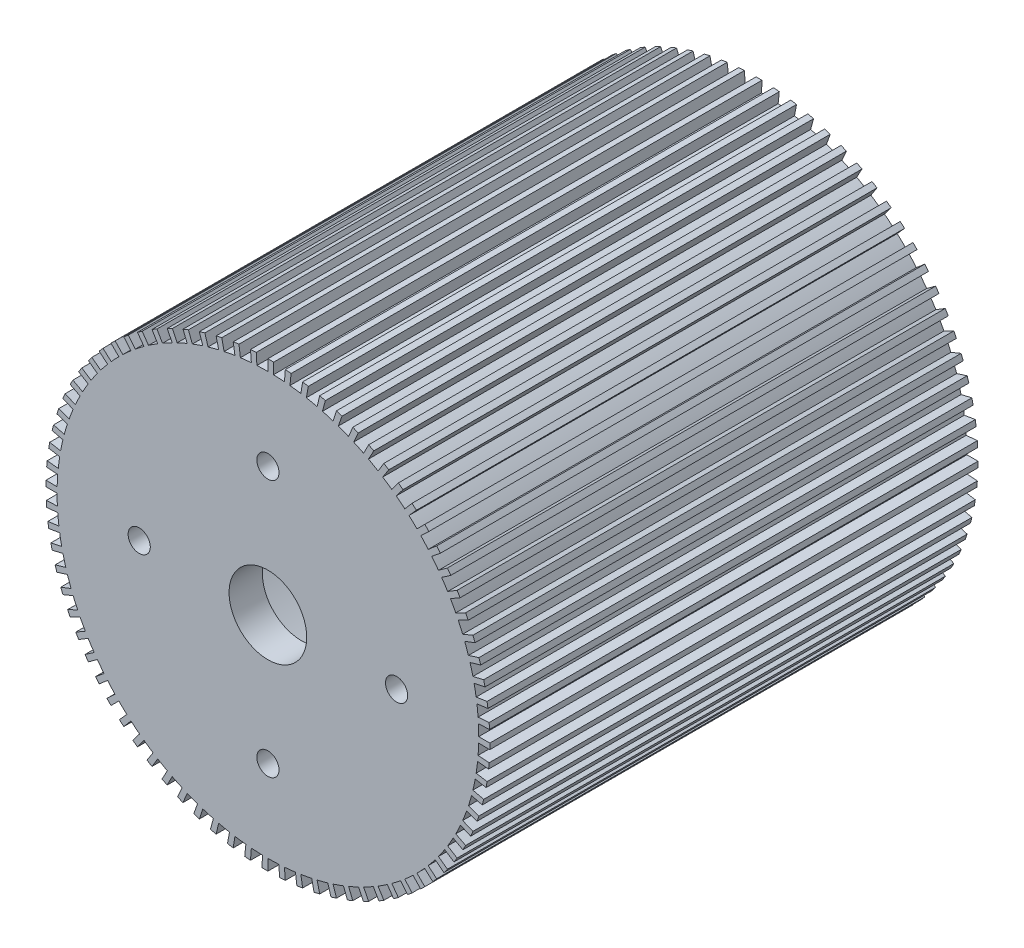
from build123d import *

# Parameters (mm, degrees)
CROQUIS1_R              = 100
SALIENTE_EXTRUIR1_DEPTH = 220
CORTAR_EXTRUIR2_DEPTH   = 220
CROQUIS5_R              = 90
CORTAR_EXTRUIR3_DEPTH   = 205
CORTAR_EXTRUIR4_REACH   = 263.534
CROQUIS6_R              = 17.5
CORTAR_EXTRUIR5_REACH   = 263.534
CROQUIS7_R              = 5


with BuildPart() as part:
    # Croquis1 → Saliente-Extruir1 (new body)
    with BuildSketch(Plane.XY):
        Circle(CROQUIS1_R)
    extrude(amount=SALIENTE_EXTRUIR1_DEPTH)

    # Croquis4 → Cortar-Extruir2 (cut)
    with BuildSketch(Plane(origin=(0, 0, 0), x_dir=(-1, 0, 0), z_dir=(0, 0, -1))):
        with BuildLine():
            Line((0, 95), (0, 100))
            ThreePointArc((0, 100), (2.617694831, 99.965732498), (5.233595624, 99.862953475))
            Line((5.233595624, 99.862953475), (4.971915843, 94.869805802))
            ThreePointArc((4.971915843, 94.869805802), (2.486810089, 94.967445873), (0, 95))
        make_face()
        with BuildLine():
            Line((7.453614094, 94.707146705), (7.845909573, 99.691733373))
            ThreePointArc((7.845909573, 99.691733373), (10.452846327, 99.452189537), (13.052619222, 99.144486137))
            Line((13.052619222, 99.144486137), (12.399988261, 94.187261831))
            ThreePointArc((12.399988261, 94.187261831), (9.93020401, 94.47958006), (7.453614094, 94.707146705))
        make_face()
        with BuildLine():
            Line((14.861274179, 93.830392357), (15.643446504, 98.76883406))
            ThreePointArc((15.643446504, 98.76883406), (18.223552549, 98.325490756), (20.791169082, 97.814760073))
            Line((20.791169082, 97.814760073), (19.751610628, 92.92402207))
            ThreePointArc((19.751610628, 92.92402207), (17.312374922, 93.409216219), (14.861274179, 93.830392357))
        make_face()
        with BuildLine():
            Line((22.177309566, 92.375142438), (23.344536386, 97.23699204))
            ThreePointArc((23.344536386, 97.23699204), (25.88190451, 96.592582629), (28.40153447, 95.881973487))
            Line((28.40153447, 95.881973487), (26.981457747, 91.087874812))
            ThreePointArc((26.981457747, 91.087874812), (24.587809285, 91.762953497), (22.177309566, 92.375142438))
        make_face()
        with BuildLine():
            Line((29.356614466, 90.350369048), (30.901699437, 95.10565163))
            ThreePointArc((30.901699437, 95.10565163), (33.380685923, 94.264149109), (35.836794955, 93.35804265))
            Line((35.836794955, 93.35804265), (34.044955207, 88.690140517))
            ThreePointArc((34.044955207, 88.690140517), (31.711651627, 89.550941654), (29.356614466, 90.350369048))
        make_face()
        with BuildLine():
            Line((36.354926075, 87.768555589), (38.268343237, 92.387953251))
            ThreePointArc((38.268343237, 92.387953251), (40.673664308, 91.354545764), (43.051109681, 90.258528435))
            Line((43.051109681, 90.258528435), (40.898554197, 85.745602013))
            ThreePointArc((40.898554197, 85.745602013), (38.639981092, 86.786818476), (36.354926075, 87.768555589))
        make_face()
        with BuildLine():
            Line((43.129097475, 84.645619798), (45.399049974, 89.100652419))
            ThreePointArc((45.399049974, 89.100652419), (47.715876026, 87.881711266), (50, 86.602540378))
            Line((50, 86.602540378), (47.5, 82.27241336))
            ThreePointArc((47.5, 82.27241336), (45.330082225, 83.487625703), (43.129097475, 84.645619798))
        make_face()
        with BuildLine():
            Line((49.637363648, 81.000815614), (52.249856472, 85.264016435))
            ThreePointArc((52.249856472, 85.264016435), (54.463903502, 83.867056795), (56.640623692, 82.412618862))
            Line((56.640623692, 82.412618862), (53.808592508, 78.291987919))
            ThreePointArc((53.808592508, 78.291987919), (51.740708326, 79.673703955), (49.637363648, 81.000815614))
        make_face()
        with BuildLine():
            Line((55.839598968, 76.856614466), (58.778525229, 80.901699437))
            ThreePointArc((58.778525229, 80.901699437), (60.876142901, 79.335334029), (62.932039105, 77.714596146))
            Line((62.932039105, 77.714596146), (59.78543715, 73.828866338))
            ThreePointArc((59.78543715, 73.828866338), (57.832335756, 75.368567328), (55.839598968, 76.856614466))
        make_face()
        with BuildLine():
            Line((61.697564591, 72.238566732), (64.944804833, 76.04059656))
            ThreePointArc((64.944804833, 76.04059656), (66.913060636, 74.314482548), (68.835457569, 72.537437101))
            Line((68.835457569, 72.537437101), (65.393684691, 68.910565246))
            ThreePointArc((65.393684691, 68.910565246), (63.567407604, 70.59875842), (61.697564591, 72.238566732))
        make_face()
        with BuildLine():
            Line((67.175144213, 67.175144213), (70.710678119, 70.710678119))
            ThreePointArc((70.710678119, 70.710678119), (72.537437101, 68.835457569), (74.314482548, 66.913060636))
            Line((74.314482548, 66.913060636), (70.59875842, 63.567407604))
            ThreePointArc((70.59875842, 63.567407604), (68.910565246, 65.393684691), (67.175144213, 67.175144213))
        make_face()
        with BuildLine():
            Line((72.238566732, 61.697564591), (76.04059656, 64.944804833))
            ThreePointArc((76.04059656, 64.944804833), (77.714596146, 62.932039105), (79.335334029, 60.876142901))
            Line((79.335334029, 60.876142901), (75.368567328, 57.832335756))
            ThreePointArc((75.368567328, 57.832335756), (73.828866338, 59.78543715), (72.238566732, 61.697564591))
        make_face()
        with BuildLine():
            Line((76.856614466, 55.839598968), (80.901699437, 58.778525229))
            ThreePointArc((80.901699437, 58.778525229), (82.412618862, 56.640623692), (83.867056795, 54.463903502))
            Line((83.867056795, 54.463903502), (79.673703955, 51.740708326))
            ThreePointArc((79.673703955, 51.740708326), (78.291987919, 53.808592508), (76.856614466, 55.839598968))
        make_face()
        with BuildLine():
            Line((81.000815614, 49.637363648), (85.264016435, 52.249856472))
            ThreePointArc((85.264016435, 52.249856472), (86.602540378, 50), (87.881711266, 47.715876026))
            Line((87.881711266, 47.715876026), (83.487625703, 45.330082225))
            ThreePointArc((83.487625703, 45.330082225), (82.27241336, 47.5), (81.000815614, 49.637363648))
        make_face()
        with BuildLine():
            Line((84.645619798, 43.129097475), (89.100652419, 45.399049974))
            ThreePointArc((89.100652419, 45.399049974), (90.258528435, 43.051109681), (91.354545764, 40.673664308))
            Line((91.354545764, 40.673664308), (86.786818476, 38.639981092))
            ThreePointArc((86.786818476, 38.639981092), (85.745602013, 40.898554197), (84.645619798, 43.129097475))
        make_face()
        with BuildLine():
            Line((87.768555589, 36.354926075), (92.387953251, 38.268343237))
            ThreePointArc((92.387953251, 38.268343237), (93.35804265, 35.836794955), (94.264149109, 33.380685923))
            Line((94.264149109, 33.380685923), (89.550941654, 31.711651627))
            ThreePointArc((89.550941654, 31.711651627), (88.690140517, 34.044955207), (87.768555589, 36.354926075))
        make_face()
        with BuildLine():
            Line((90.350369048, 29.356614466), (95.10565163, 30.901699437))
            ThreePointArc((95.10565163, 30.901699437), (95.881973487, 28.40153447), (96.592582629, 25.88190451))
            Line((96.592582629, 25.88190451), (91.762953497, 24.587809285))
            ThreePointArc((91.762953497, 24.587809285), (91.087874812, 26.981457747), (90.350369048, 29.356614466))
        make_face()
        with BuildLine():
            Line((92.375142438, 22.177309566), (97.23699204, 23.344536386))
            ThreePointArc((97.23699204, 23.344536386), (97.814760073, 20.791169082), (98.325490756, 18.223552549))
            Line((98.325490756, 18.223552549), (93.409216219, 17.312374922))
            ThreePointArc((93.409216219, 17.312374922), (92.92402207, 19.751610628), (92.375142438, 22.177309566))
        make_face()
        with BuildLine():
            Line((93.830392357, 14.861274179), (98.76883406, 15.643446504))
            ThreePointArc((98.76883406, 15.643446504), (99.144486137, 13.052619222), (99.452189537, 10.452846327))
            Line((99.452189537, 10.452846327), (94.47958006, 9.93020401))
            ThreePointArc((94.47958006, 9.93020401), (94.187261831, 12.399988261), (93.830392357, 14.861274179))
        make_face()
        with BuildLine():
            Line((94.707146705, 7.453614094), (99.691733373, 7.845909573))
            ThreePointArc((99.691733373, 7.845909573), (99.862953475, 5.233595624), (99.965732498, 2.617694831))
            Line((99.965732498, 2.617694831), (94.967445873, 2.486810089))
            ThreePointArc((94.967445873, 2.486810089), (94.869805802, 4.971915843), (94.707146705, 7.453614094))
        make_face()
        with BuildLine():
            Line((95, 0), (100, 0))
            ThreePointArc((100, 0), (99.965732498, -2.617694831), (99.862953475, -5.233595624))
            Line((99.862953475, -5.233595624), (94.869805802, -4.971915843))
            ThreePointArc((94.869805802, -4.971915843), (94.967445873, -2.486810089), (95, 0))
        make_face()
        with BuildLine():
            Line((94.707146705, -7.453614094), (99.691733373, -7.845909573))
            ThreePointArc((99.691733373, -7.845909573), (99.452189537, -10.452846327), (99.144486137, -13.052619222))
            Line((99.144486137, -13.052619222), (94.187261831, -12.399988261))
            ThreePointArc((94.187261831, -12.399988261), (94.47958006, -9.93020401), (94.707146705, -7.453614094))
        make_face()
        with BuildLine():
            Line((93.830392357, -14.861274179), (98.76883406, -15.643446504))
            ThreePointArc((98.76883406, -15.643446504), (98.325490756, -18.223552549), (97.814760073, -20.791169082))
            Line((97.814760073, -20.791169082), (92.92402207, -19.751610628))
            ThreePointArc((92.92402207, -19.751610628), (93.409216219, -17.312374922), (93.830392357, -14.861274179))
        make_face()
        with BuildLine():
            Line((92.375142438, -22.177309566), (97.23699204, -23.344536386))
            ThreePointArc((97.23699204, -23.344536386), (96.592582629, -25.88190451), (95.881973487, -28.40153447))
            Line((95.881973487, -28.40153447), (91.087874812, -26.981457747))
            ThreePointArc((91.087874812, -26.981457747), (91.762953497, -24.587809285), (92.375142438, -22.177309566))
        make_face()
        with BuildLine():
            Line((90.350369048, -29.356614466), (95.10565163, -30.901699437))
            ThreePointArc((95.10565163, -30.901699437), (94.264149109, -33.380685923), (93.35804265, -35.836794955))
            Line((93.35804265, -35.836794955), (88.690140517, -34.044955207))
            ThreePointArc((88.690140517, -34.044955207), (89.550941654, -31.711651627), (90.350369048, -29.356614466))
        make_face()
        with BuildLine():
            Line((87.768555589, -36.354926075), (92.387953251, -38.268343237))
            ThreePointArc((92.387953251, -38.268343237), (91.354545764, -40.673664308), (90.258528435, -43.051109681))
            Line((90.258528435, -43.051109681), (85.745602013, -40.898554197))
            ThreePointArc((85.745602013, -40.898554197), (86.786818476, -38.639981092), (87.768555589, -36.354926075))
        make_face()
        with BuildLine():
            Line((84.645619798, -43.129097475), (89.100652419, -45.399049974))
            ThreePointArc((89.100652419, -45.399049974), (87.881711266, -47.715876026), (86.602540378, -50))
            Line((86.602540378, -50), (82.27241336, -47.5))
            ThreePointArc((82.27241336, -47.5), (83.487625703, -45.330082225), (84.645619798, -43.129097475))
        make_face()
        with BuildLine():
            Line((81.000815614, -49.637363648), (85.264016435, -52.249856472))
            ThreePointArc((85.264016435, -52.249856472), (83.867056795, -54.463903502), (82.412618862, -56.640623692))
            Line((82.412618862, -56.640623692), (78.291987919, -53.808592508))
            ThreePointArc((78.291987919, -53.808592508), (79.673703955, -51.740708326), (81.000815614, -49.637363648))
        make_face()
        with BuildLine():
            Line((76.856614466, -55.839598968), (80.901699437, -58.778525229))
            ThreePointArc((80.901699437, -58.778525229), (79.335334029, -60.876142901), (77.714596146, -62.932039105))
            Line((77.714596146, -62.932039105), (73.828866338, -59.78543715))
            ThreePointArc((73.828866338, -59.78543715), (75.368567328, -57.832335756), (76.856614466, -55.839598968))
        make_face()
        with BuildLine():
            Line((72.238566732, -61.697564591), (76.04059656, -64.944804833))
            ThreePointArc((76.04059656, -64.944804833), (74.314482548, -66.913060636), (72.537437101, -68.835457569))
            Line((72.537437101, -68.835457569), (68.910565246, -65.393684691))
            ThreePointArc((68.910565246, -65.393684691), (70.59875842, -63.567407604), (72.238566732, -61.697564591))
        make_face()
        with BuildLine():
            Line((67.175144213, -67.175144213), (70.710678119, -70.710678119))
            ThreePointArc((70.710678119, -70.710678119), (68.835457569, -72.537437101), (66.913060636, -74.314482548))
            Line((66.913060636, -74.314482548), (63.567407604, -70.59875842))
            ThreePointArc((63.567407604, -70.59875842), (65.393684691, -68.910565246), (67.175144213, -67.175144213))
        make_face()
        with BuildLine():
            Line((61.697564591, -72.238566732), (64.944804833, -76.04059656))
            ThreePointArc((64.944804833, -76.04059656), (62.932039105, -77.714596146), (60.876142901, -79.335334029))
            Line((60.876142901, -79.335334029), (57.832335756, -75.368567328))
            ThreePointArc((57.832335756, -75.368567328), (59.78543715, -73.828866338), (61.697564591, -72.238566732))
        make_face()
        with BuildLine():
            Line((55.839598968, -76.856614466), (58.778525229, -80.901699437))
            ThreePointArc((58.778525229, -80.901699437), (56.640623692, -82.412618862), (54.463903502, -83.867056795))
            Line((54.463903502, -83.867056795), (51.740708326, -79.673703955))
            ThreePointArc((51.740708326, -79.673703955), (53.808592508, -78.291987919), (55.839598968, -76.856614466))
        make_face()
        with BuildLine():
            Line((49.637363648, -81.000815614), (52.249856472, -85.264016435))
            ThreePointArc((52.249856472, -85.264016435), (50, -86.602540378), (47.715876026, -87.881711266))
            Line((47.715876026, -87.881711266), (45.330082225, -83.487625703))
            ThreePointArc((45.330082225, -83.487625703), (47.5, -82.27241336), (49.637363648, -81.000815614))
        make_face()
        with BuildLine():
            Line((43.129097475, -84.645619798), (45.399049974, -89.100652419))
            ThreePointArc((45.399049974, -89.100652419), (43.051109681, -90.258528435), (40.673664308, -91.354545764))
            Line((40.673664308, -91.354545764), (38.639981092, -86.786818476))
            ThreePointArc((38.639981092, -86.786818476), (40.898554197, -85.745602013), (43.129097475, -84.645619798))
        make_face()
        with BuildLine():
            Line((36.354926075, -87.768555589), (38.268343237, -92.387953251))
            ThreePointArc((38.268343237, -92.387953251), (35.836794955, -93.35804265), (33.380685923, -94.264149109))
            Line((33.380685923, -94.264149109), (31.711651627, -89.550941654))
            ThreePointArc((31.711651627, -89.550941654), (34.044955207, -88.690140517), (36.354926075, -87.768555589))
        make_face()
        with BuildLine():
            Line((29.356614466, -90.350369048), (30.901699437, -95.10565163))
            ThreePointArc((30.901699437, -95.10565163), (28.40153447, -95.881973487), (25.88190451, -96.592582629))
            Line((25.88190451, -96.592582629), (24.587809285, -91.762953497))
            ThreePointArc((24.587809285, -91.762953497), (26.981457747, -91.087874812), (29.356614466, -90.350369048))
        make_face()
        with BuildLine():
            Line((22.177309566, -92.375142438), (23.344536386, -97.23699204))
            ThreePointArc((23.344536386, -97.23699204), (20.791169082, -97.814760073), (18.223552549, -98.325490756))
            Line((18.223552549, -98.325490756), (17.312374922, -93.409216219))
            ThreePointArc((17.312374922, -93.409216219), (19.751610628, -92.92402207), (22.177309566, -92.375142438))
        make_face()
        with BuildLine():
            Line((14.861274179, -93.830392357), (15.643446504, -98.76883406))
            ThreePointArc((15.643446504, -98.76883406), (13.052619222, -99.144486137), (10.452846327, -99.452189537))
            Line((10.452846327, -99.452189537), (9.93020401, -94.47958006))
            ThreePointArc((9.93020401, -94.47958006), (12.399988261, -94.187261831), (14.861274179, -93.830392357))
        make_face()
        with BuildLine():
            Line((7.453614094, -94.707146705), (7.845909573, -99.691733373))
            ThreePointArc((7.845909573, -99.691733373), (5.233595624, -99.862953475), (2.617694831, -99.965732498))
            Line((2.617694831, -99.965732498), (2.486810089, -94.967445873))
            ThreePointArc((2.486810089, -94.967445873), (4.971915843, -94.869805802), (7.453614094, -94.707146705))
        make_face()
        with BuildLine():
            Line((0, -95), (0, -100))
            ThreePointArc((0, -100), (-2.617694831, -99.965732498), (-5.233595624, -99.862953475))
            Line((-5.233595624, -99.862953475), (-4.971915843, -94.869805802))
            ThreePointArc((-4.971915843, -94.869805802), (-2.486810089, -94.967445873), (0, -95))
        make_face()
        with BuildLine():
            Line((-7.453614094, -94.707146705), (-7.845909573, -99.691733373))
            ThreePointArc((-7.845909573, -99.691733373), (-10.452846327, -99.452189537), (-13.052619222, -99.144486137))
            Line((-13.052619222, -99.144486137), (-12.399988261, -94.187261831))
            ThreePointArc((-12.399988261, -94.187261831), (-9.93020401, -94.47958006), (-7.453614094, -94.707146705))
        make_face()
        with BuildLine():
            Line((-14.861274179, -93.830392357), (-15.643446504, -98.76883406))
            ThreePointArc((-15.643446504, -98.76883406), (-18.223552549, -98.325490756), (-20.791169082, -97.814760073))
            Line((-20.791169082, -97.814760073), (-19.751610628, -92.92402207))
            ThreePointArc((-19.751610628, -92.92402207), (-17.312374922, -93.409216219), (-14.861274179, -93.830392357))
        make_face()
        with BuildLine():
            Line((-22.177309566, -92.375142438), (-23.344536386, -97.23699204))
            ThreePointArc((-23.344536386, -97.23699204), (-25.88190451, -96.592582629), (-28.40153447, -95.881973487))
            Line((-28.40153447, -95.881973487), (-26.981457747, -91.087874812))
            ThreePointArc((-26.981457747, -91.087874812), (-24.587809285, -91.762953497), (-22.177309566, -92.375142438))
        make_face()
        with BuildLine():
            Line((-29.356614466, -90.350369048), (-30.901699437, -95.10565163))
            ThreePointArc((-30.901699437, -95.10565163), (-33.380685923, -94.264149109), (-35.836794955, -93.35804265))
            Line((-35.836794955, -93.35804265), (-34.044955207, -88.690140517))
            ThreePointArc((-34.044955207, -88.690140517), (-31.711651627, -89.550941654), (-29.356614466, -90.350369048))
        make_face()
        with BuildLine():
            Line((-36.354926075, -87.768555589), (-38.268343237, -92.387953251))
            ThreePointArc((-38.268343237, -92.387953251), (-40.673664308, -91.354545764), (-43.051109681, -90.258528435))
            Line((-43.051109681, -90.258528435), (-40.898554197, -85.745602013))
            ThreePointArc((-40.898554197, -85.745602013), (-38.639981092, -86.786818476), (-36.354926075, -87.768555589))
        make_face()
        with BuildLine():
            Line((-43.129097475, -84.645619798), (-45.399049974, -89.100652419))
            ThreePointArc((-45.399049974, -89.100652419), (-47.715876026, -87.881711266), (-50, -86.602540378))
            Line((-50, -86.602540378), (-47.5, -82.27241336))
            ThreePointArc((-47.5, -82.27241336), (-45.330082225, -83.487625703), (-43.129097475, -84.645619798))
        make_face()
        with BuildLine():
            Line((-49.637363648, -81.000815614), (-52.249856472, -85.264016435))
            ThreePointArc((-52.249856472, -85.264016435), (-54.463903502, -83.867056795), (-56.640623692, -82.412618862))
            Line((-56.640623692, -82.412618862), (-53.808592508, -78.291987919))
            ThreePointArc((-53.808592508, -78.291987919), (-51.740708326, -79.673703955), (-49.637363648, -81.000815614))
        make_face()
        with BuildLine():
            Line((-55.839598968, -76.856614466), (-58.778525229, -80.901699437))
            ThreePointArc((-58.778525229, -80.901699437), (-60.876142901, -79.335334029), (-62.932039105, -77.714596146))
            Line((-62.932039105, -77.714596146), (-59.78543715, -73.828866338))
            ThreePointArc((-59.78543715, -73.828866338), (-57.832335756, -75.368567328), (-55.839598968, -76.856614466))
        make_face()
        with BuildLine():
            Line((-61.697564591, -72.238566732), (-64.944804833, -76.04059656))
            ThreePointArc((-64.944804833, -76.04059656), (-66.913060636, -74.314482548), (-68.835457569, -72.537437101))
            Line((-68.835457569, -72.537437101), (-65.393684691, -68.910565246))
            ThreePointArc((-65.393684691, -68.910565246), (-63.567407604, -70.59875842), (-61.697564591, -72.238566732))
        make_face()
        with BuildLine():
            Line((-67.175144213, -67.175144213), (-70.710678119, -70.710678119))
            ThreePointArc((-70.710678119, -70.710678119), (-72.537437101, -68.835457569), (-74.314482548, -66.913060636))
            Line((-74.314482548, -66.913060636), (-70.59875842, -63.567407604))
            ThreePointArc((-70.59875842, -63.567407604), (-68.910565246, -65.393684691), (-67.175144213, -67.175144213))
        make_face()
        with BuildLine():
            Line((-72.238566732, -61.697564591), (-76.04059656, -64.944804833))
            ThreePointArc((-76.04059656, -64.944804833), (-77.714596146, -62.932039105), (-79.335334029, -60.876142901))
            Line((-79.335334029, -60.876142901), (-75.368567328, -57.832335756))
            ThreePointArc((-75.368567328, -57.832335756), (-73.828866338, -59.78543715), (-72.238566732, -61.697564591))
        make_face()
        with BuildLine():
            Line((-76.856614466, -55.839598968), (-80.901699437, -58.778525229))
            ThreePointArc((-80.901699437, -58.778525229), (-82.412618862, -56.640623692), (-83.867056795, -54.463903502))
            Line((-83.867056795, -54.463903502), (-79.673703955, -51.740708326))
            ThreePointArc((-79.673703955, -51.740708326), (-78.291987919, -53.808592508), (-76.856614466, -55.839598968))
        make_face()
        with BuildLine():
            Line((-81.000815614, -49.637363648), (-85.264016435, -52.249856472))
            ThreePointArc((-85.264016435, -52.249856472), (-86.602540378, -50), (-87.881711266, -47.715876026))
            Line((-87.881711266, -47.715876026), (-83.487625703, -45.330082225))
            ThreePointArc((-83.487625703, -45.330082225), (-82.27241336, -47.5), (-81.000815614, -49.637363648))
        make_face()
        with BuildLine():
            Line((-84.645619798, -43.129097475), (-89.100652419, -45.399049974))
            ThreePointArc((-89.100652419, -45.399049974), (-90.258528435, -43.051109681), (-91.354545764, -40.673664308))
            Line((-91.354545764, -40.673664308), (-86.786818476, -38.639981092))
            ThreePointArc((-86.786818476, -38.639981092), (-85.745602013, -40.898554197), (-84.645619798, -43.129097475))
        make_face()
        with BuildLine():
            Line((-87.768555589, -36.354926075), (-92.387953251, -38.268343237))
            ThreePointArc((-92.387953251, -38.268343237), (-93.35804265, -35.836794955), (-94.264149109, -33.380685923))
            Line((-94.264149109, -33.380685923), (-89.550941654, -31.711651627))
            ThreePointArc((-89.550941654, -31.711651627), (-88.690140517, -34.044955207), (-87.768555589, -36.354926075))
        make_face()
        with BuildLine():
            Line((-90.350369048, -29.356614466), (-95.10565163, -30.901699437))
            ThreePointArc((-95.10565163, -30.901699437), (-95.881973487, -28.40153447), (-96.592582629, -25.88190451))
            Line((-96.592582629, -25.88190451), (-91.762953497, -24.587809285))
            ThreePointArc((-91.762953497, -24.587809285), (-91.087874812, -26.981457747), (-90.350369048, -29.356614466))
        make_face()
        with BuildLine():
            Line((-92.375142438, -22.177309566), (-97.23699204, -23.344536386))
            ThreePointArc((-97.23699204, -23.344536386), (-97.814760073, -20.791169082), (-98.325490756, -18.223552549))
            Line((-98.325490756, -18.223552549), (-93.409216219, -17.312374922))
            ThreePointArc((-93.409216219, -17.312374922), (-92.92402207, -19.751610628), (-92.375142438, -22.177309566))
        make_face()
        with BuildLine():
            Line((-93.830392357, -14.861274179), (-98.76883406, -15.643446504))
            ThreePointArc((-98.76883406, -15.643446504), (-99.144486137, -13.052619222), (-99.452189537, -10.452846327))
            Line((-99.452189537, -10.452846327), (-94.47958006, -9.93020401))
            ThreePointArc((-94.47958006, -9.93020401), (-94.187261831, -12.399988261), (-93.830392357, -14.861274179))
        make_face()
        with BuildLine():
            Line((-94.707146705, -7.453614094), (-99.691733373, -7.845909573))
            ThreePointArc((-99.691733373, -7.845909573), (-99.862953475, -5.233595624), (-99.965732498, -2.617694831))
            Line((-99.965732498, -2.617694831), (-94.967445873, -2.486810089))
            ThreePointArc((-94.967445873, -2.486810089), (-94.869805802, -4.971915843), (-94.707146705, -7.453614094))
        make_face()
        with BuildLine():
            Line((-95, 0), (-100, 0))
            ThreePointArc((-100, 0), (-99.965732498, 2.617694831), (-99.862953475, 5.233595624))
            Line((-99.862953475, 5.233595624), (-94.869805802, 4.971915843))
            ThreePointArc((-94.869805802, 4.971915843), (-94.967445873, 2.486810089), (-95, 0))
        make_face()
        with BuildLine():
            Line((-94.707146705, 7.453614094), (-99.691733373, 7.845909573))
            ThreePointArc((-99.691733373, 7.845909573), (-99.452189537, 10.452846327), (-99.144486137, 13.052619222))
            Line((-99.144486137, 13.052619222), (-94.187261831, 12.399988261))
            ThreePointArc((-94.187261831, 12.399988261), (-94.47958006, 9.93020401), (-94.707146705, 7.453614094))
        make_face()
        with BuildLine():
            Line((-93.830392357, 14.861274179), (-98.76883406, 15.643446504))
            ThreePointArc((-98.76883406, 15.643446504), (-98.325490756, 18.223552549), (-97.814760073, 20.791169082))
            Line((-97.814760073, 20.791169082), (-92.92402207, 19.751610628))
            ThreePointArc((-92.92402207, 19.751610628), (-93.409216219, 17.312374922), (-93.830392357, 14.861274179))
        make_face()
        with BuildLine():
            Line((-92.375142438, 22.177309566), (-97.23699204, 23.344536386))
            ThreePointArc((-97.23699204, 23.344536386), (-96.592582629, 25.88190451), (-95.881973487, 28.40153447))
            Line((-95.881973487, 28.40153447), (-91.087874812, 26.981457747))
            ThreePointArc((-91.087874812, 26.981457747), (-91.762953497, 24.587809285), (-92.375142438, 22.177309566))
        make_face()
        with BuildLine():
            Line((-90.350369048, 29.356614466), (-95.10565163, 30.901699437))
            ThreePointArc((-95.10565163, 30.901699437), (-94.264149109, 33.380685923), (-93.35804265, 35.836794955))
            Line((-93.35804265, 35.836794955), (-88.690140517, 34.044955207))
            ThreePointArc((-88.690140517, 34.044955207), (-89.550941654, 31.711651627), (-90.350369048, 29.356614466))
        make_face()
        with BuildLine():
            Line((-87.768555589, 36.354926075), (-92.387953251, 38.268343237))
            ThreePointArc((-92.387953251, 38.268343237), (-91.354545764, 40.673664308), (-90.258528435, 43.051109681))
            Line((-90.258528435, 43.051109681), (-85.745602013, 40.898554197))
            ThreePointArc((-85.745602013, 40.898554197), (-86.786818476, 38.639981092), (-87.768555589, 36.354926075))
        make_face()
        with BuildLine():
            Line((-84.645619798, 43.129097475), (-89.100652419, 45.399049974))
            ThreePointArc((-89.100652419, 45.399049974), (-87.881711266, 47.715876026), (-86.602540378, 50))
            Line((-86.602540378, 50), (-82.27241336, 47.5))
            ThreePointArc((-82.27241336, 47.5), (-83.487625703, 45.330082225), (-84.645619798, 43.129097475))
        make_face()
        with BuildLine():
            Line((-81.000815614, 49.637363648), (-85.264016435, 52.249856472))
            ThreePointArc((-85.264016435, 52.249856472), (-83.867056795, 54.463903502), (-82.412618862, 56.640623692))
            Line((-82.412618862, 56.640623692), (-78.291987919, 53.808592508))
            ThreePointArc((-78.291987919, 53.808592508), (-79.673703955, 51.740708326), (-81.000815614, 49.637363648))
        make_face()
        with BuildLine():
            Line((-76.856614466, 55.839598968), (-80.901699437, 58.778525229))
            ThreePointArc((-80.901699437, 58.778525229), (-79.335334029, 60.876142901), (-77.714596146, 62.932039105))
            Line((-77.714596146, 62.932039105), (-73.828866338, 59.78543715))
            ThreePointArc((-73.828866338, 59.78543715), (-75.368567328, 57.832335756), (-76.856614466, 55.839598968))
        make_face()
        with BuildLine():
            Line((-72.238566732, 61.697564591), (-76.04059656, 64.944804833))
            ThreePointArc((-76.04059656, 64.944804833), (-74.314482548, 66.913060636), (-72.537437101, 68.835457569))
            Line((-72.537437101, 68.835457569), (-68.910565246, 65.393684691))
            ThreePointArc((-68.910565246, 65.393684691), (-70.59875842, 63.567407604), (-72.238566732, 61.697564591))
        make_face()
        with BuildLine():
            Line((-67.175144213, 67.175144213), (-70.710678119, 70.710678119))
            ThreePointArc((-70.710678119, 70.710678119), (-68.835457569, 72.537437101), (-66.913060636, 74.314482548))
            Line((-66.913060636, 74.314482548), (-63.567407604, 70.59875842))
            ThreePointArc((-63.567407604, 70.59875842), (-65.393684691, 68.910565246), (-67.175144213, 67.175144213))
        make_face()
        with BuildLine():
            Line((-61.697564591, 72.238566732), (-64.944804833, 76.04059656))
            ThreePointArc((-64.944804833, 76.04059656), (-62.932039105, 77.714596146), (-60.876142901, 79.335334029))
            Line((-60.876142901, 79.335334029), (-57.832335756, 75.368567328))
            ThreePointArc((-57.832335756, 75.368567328), (-59.78543715, 73.828866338), (-61.697564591, 72.238566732))
        make_face()
        with BuildLine():
            Line((-55.839598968, 76.856614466), (-58.778525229, 80.901699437))
            ThreePointArc((-58.778525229, 80.901699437), (-56.640623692, 82.412618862), (-54.463903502, 83.867056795))
            Line((-54.463903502, 83.867056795), (-51.740708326, 79.673703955))
            ThreePointArc((-51.740708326, 79.673703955), (-53.808592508, 78.291987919), (-55.839598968, 76.856614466))
        make_face()
        with BuildLine():
            Line((-49.637363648, 81.000815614), (-52.249856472, 85.264016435))
            ThreePointArc((-52.249856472, 85.264016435), (-50, 86.602540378), (-47.715876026, 87.881711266))
            Line((-47.715876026, 87.881711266), (-45.330082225, 83.487625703))
            ThreePointArc((-45.330082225, 83.487625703), (-47.5, 82.27241336), (-49.637363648, 81.000815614))
        make_face()
        with BuildLine():
            Line((-43.129097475, 84.645619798), (-45.399049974, 89.100652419))
            ThreePointArc((-45.399049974, 89.100652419), (-43.051109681, 90.258528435), (-40.673664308, 91.354545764))
            Line((-40.673664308, 91.354545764), (-38.639981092, 86.786818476))
            ThreePointArc((-38.639981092, 86.786818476), (-40.898554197, 85.745602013), (-43.129097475, 84.645619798))
        make_face()
        with BuildLine():
            Line((-36.354926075, 87.768555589), (-38.268343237, 92.387953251))
            ThreePointArc((-38.268343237, 92.387953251), (-35.836794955, 93.35804265), (-33.380685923, 94.264149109))
            Line((-33.380685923, 94.264149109), (-31.711651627, 89.550941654))
            ThreePointArc((-31.711651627, 89.550941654), (-34.044955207, 88.690140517), (-36.354926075, 87.768555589))
        make_face()
        with BuildLine():
            Line((-29.356614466, 90.350369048), (-30.901699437, 95.10565163))
            ThreePointArc((-30.901699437, 95.10565163), (-28.40153447, 95.881973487), (-25.88190451, 96.592582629))
            Line((-25.88190451, 96.592582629), (-24.587809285, 91.762953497))
            ThreePointArc((-24.587809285, 91.762953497), (-26.981457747, 91.087874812), (-29.356614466, 90.350369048))
        make_face()
        with BuildLine():
            Line((-22.177309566, 92.375142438), (-23.344536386, 97.23699204))
            ThreePointArc((-23.344536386, 97.23699204), (-20.791169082, 97.814760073), (-18.223552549, 98.325490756))
            Line((-18.223552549, 98.325490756), (-17.312374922, 93.409216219))
            ThreePointArc((-17.312374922, 93.409216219), (-19.751610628, 92.92402207), (-22.177309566, 92.375142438))
        make_face()
        with BuildLine():
            Line((-14.861274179, 93.830392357), (-15.643446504, 98.76883406))
            ThreePointArc((-15.643446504, 98.76883406), (-13.052619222, 99.144486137), (-10.452846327, 99.452189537))
            Line((-10.452846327, 99.452189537), (-9.93020401, 94.47958006))
            ThreePointArc((-9.93020401, 94.47958006), (-12.399988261, 94.187261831), (-14.861274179, 93.830392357))
        make_face()
        with BuildLine():
            Line((-7.453614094, 94.707146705), (-7.845909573, 99.691733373))
            ThreePointArc((-7.845909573, 99.691733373), (-5.233595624, 99.862953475), (-2.617694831, 99.965732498))
            Line((-2.617694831, 99.965732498), (-2.486810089, 94.967445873))
            ThreePointArc((-2.486810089, 94.967445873), (-4.971915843, 94.869805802), (-7.453614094, 94.707146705))
        make_face()
    extrude(amount=-CORTAR_EXTRUIR2_DEPTH, mode=Mode.SUBTRACT)

    # Croquis5 → Cortar-Extruir3 (cut)
    with BuildSketch(Plane(origin=(0, 0, 0), x_dir=(-1, 0, 0), z_dir=(0, 0, -1))):
        Circle(CROQUIS5_R)
    extrude(amount=-CORTAR_EXTRUIR3_DEPTH, mode=Mode.SUBTRACT)

    # Croquis6 → Cortar-Extruir4 (cut, up to next)
    with BuildSketch(Plane.XY.offset(220), mode=Mode.PRIVATE) as cortar_extruir4_sk1:
        Circle(CROQUIS6_R)
    cortar_extruir4_tool1 = extrude(cortar_extruir4_sk1.sketch, amount=-CORTAR_EXTRUIR4_REACH, mode=Mode.PRIVATE) & part.part
    add(cortar_extruir4_tool1.solids().sort_by_distance((0, 0, 220))[0], mode=Mode.SUBTRACT)

    # Croquis7 → Cortar-Extruir5 (cut, up to next)
    with BuildSketch(Plane.XY.offset(220), mode=Mode.PRIVATE) as cortar_extruir5_sk1:
        with Locations((0, 58)):
            Circle(CROQUIS7_R)
    cortar_extruir5_tool1 = extrude(cortar_extruir5_sk1.sketch, amount=-CORTAR_EXTRUIR5_REACH, mode=Mode.PRIVATE) & part.part
    # Croquis7 → Cortar-Extruir5 (cut, up to next)
    with BuildSketch(Plane.XY.offset(220), mode=Mode.PRIVATE) as cortar_extruir5_sk2:
        with Locations((58, 0)):
            Circle(CROQUIS7_R)
    cortar_extruir5_tool2 = extrude(cortar_extruir5_sk2.sketch, amount=-CORTAR_EXTRUIR5_REACH, mode=Mode.PRIVATE) & part.part
    # Croquis7 → Cortar-Extruir5 (cut, up to next)
    with BuildSketch(Plane.XY.offset(220), mode=Mode.PRIVATE) as cortar_extruir5_sk3:
        with Locations((0, -58)):
            Circle(CROQUIS7_R)
    cortar_extruir5_tool3 = extrude(cortar_extruir5_sk3.sketch, amount=-CORTAR_EXTRUIR5_REACH, mode=Mode.PRIVATE) & part.part
    # Croquis7 → Cortar-Extruir5 (cut, up to next)
    with BuildSketch(Plane.XY.offset(220), mode=Mode.PRIVATE) as cortar_extruir5_sk4:
        with Locations((-58, 0)):
            Circle(CROQUIS7_R)
    cortar_extruir5_tool4 = extrude(cortar_extruir5_sk4.sketch, amount=-CORTAR_EXTRUIR5_REACH, mode=Mode.PRIVATE) & part.part
    add(cortar_extruir5_tool1.solids().sort_by_distance((0, 58, 220))[0], mode=Mode.SUBTRACT)
    add(cortar_extruir5_tool2.solids().sort_by_distance((58, 0, 220))[0], mode=Mode.SUBTRACT)
    add(cortar_extruir5_tool3.solids().sort_by_distance((0, -58, 220))[0], mode=Mode.SUBTRACT)
    add(cortar_extruir5_tool4.solids().sort_by_distance((-58, 0, 220))[0], mode=Mode.SUBTRACT)


solid = part.part
